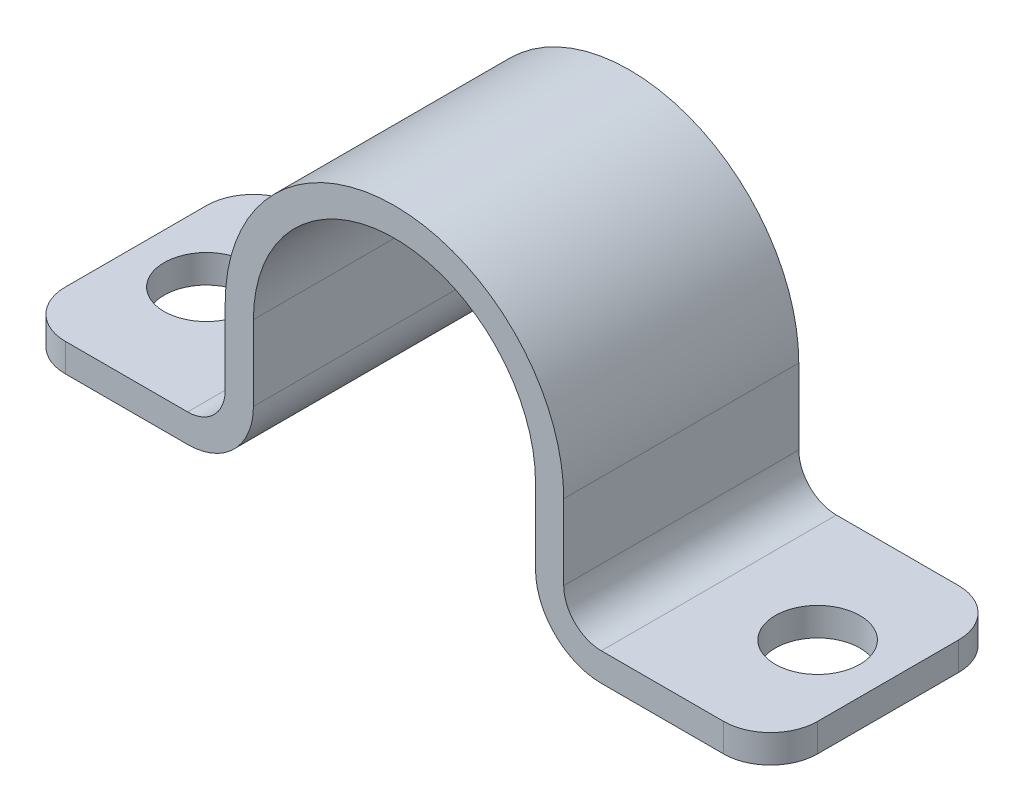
from build123d import *

# Parameters (mm, degrees)
BASE_EXTRUSION_DEPTH    = 25
CONG_1_R                = 5
ESQUISSE2_R             = 4.5
ENL_V_MAT_EXTRU_1_DEPTH = 58.567351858


with BuildPart() as part:
    # Esquisse1 → Base-Extrusion (new body)
    with BuildSketch(Plane.XY):
        with BuildLine():
            Line((-40, 3), (-22, 3))
            ThreePointArc((-22, 3), (-19.171572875, 4.171572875), (-18, 7))
            Line((-18, 7), (-18, 15))
            ThreePointArc((-18, 15), (0, 33), (18, 15))
            Line((18, 15), (18, 7))
            ThreePointArc((18, 7), (19.171572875, 4.171572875), (22, 3))
            Line((22, 3), (40, 3))
            Line((40, 3), (40, 0))
            Line((40, 0), (22, 0))
            ThreePointArc((22, 0), (17.050252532, 2.050252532), (15, 7))
            Line((15, 7), (15, 15))
            ThreePointArc((15, 15), (0, 30), (-15, 15))
            Line((-15, 15), (-15, 7))
            ThreePointArc((-15, 7), (-17.050252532, 2.050252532), (-22, 0))
            Line((-22, 0), (-40, 0))
            Line((-40, 0), (-40, 3))
        make_face()
    extrude(amount=BASE_EXTRUSION_DEPTH)

    # Cong_1
    cong_1_edges = [part.edges().sort_by_distance(p)[0] for p in [
        (-40, 1.5, 0),
        (-40, 1.5, 25),
        (40, 1.5, 0),
        (40, 1.5, 25),
    ]]
    fillet(cong_1_edges, radius=CONG_1_R)

    # Esquisse2 → Enl_v. mat.-Extru.1 (cut, through all)
    with BuildSketch(Plane.XZ):
        with Locations((-32.5, 12.5)):
            Circle(ESQUISSE2_R)
        with Locations((32.5, 12.5)):
            Circle(ESQUISSE2_R)
    extrude(amount=-ENL_V_MAT_EXTRU_1_DEPTH, mode=Mode.SUBTRACT)


solid = part.part
